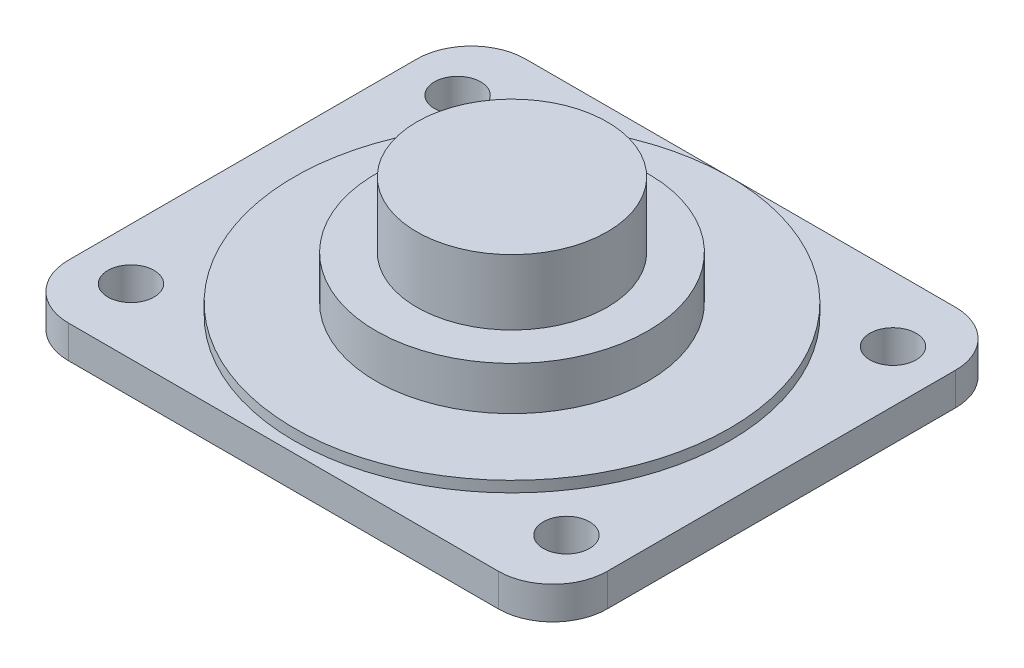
from build123d import *

# Parameters (mm, degrees)
ESQUISSE1_R      = 4.25
EXTRUSION1_DEPTH = 6


with BuildPart() as part:
    # Esquisse1 → Extrusion1 (new body)
    with BuildSketch(Plane(origin=(0, 0, 0), x_dir=(1, 0, 0), z_dir=(0, 1, 0))):
        with BuildLine():
            Line((-39.5, 42), (39.5, 42))
            ThreePointArc((39.5, 42), (46.571067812, 39.071067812), (49.5, 32))
            Line((49.5, 32), (49.5, -32))
            ThreePointArc((49.5, -32), (46.571067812, -39.071067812), (39.5, -42))
            Line((39.5, -42), (-39.5, -42))
            ThreePointArc((-39.5, -42), (-46.571067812, -39.071067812), (-49.5, -32))
            Line((-49.5, -32), (-49.5, 32))
            ThreePointArc((-49.5, 32), (-46.571067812, 39.071067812), (-39.5, 42))
        make_face()
        with Locations(Location((-40, 30, 0), (0, 0, 270))):
            Circle(ESQUISSE1_R, mode=Mode.SUBTRACT)
        with Locations(Location((40, 30, 0), (0, 0, 270))):
            Circle(ESQUISSE1_R, mode=Mode.SUBTRACT)
        with Locations(Location((40, -30, 0), (0, 0, 270))):
            Circle(ESQUISSE1_R, mode=Mode.SUBTRACT)
        with Locations(Location((-40, -30, 0), (0, 0, 270))):
            Circle(ESQUISSE1_R, mode=Mode.SUBTRACT)
    extrude(amount=EXTRUSION1_DEPTH)

    # Esquisse3 → R_volution1 (revolve)
    with BuildSketch(Plane.XY):
        Polygon((0, 6), (0, 28), (17.5, 28), (17.5, 16), (25, 16), (25, 8), (40, 8), (40, 6), align=None)
    revolve(axis=Axis((0, 6, 0), (0, 1, 0)))


solid = part.part
